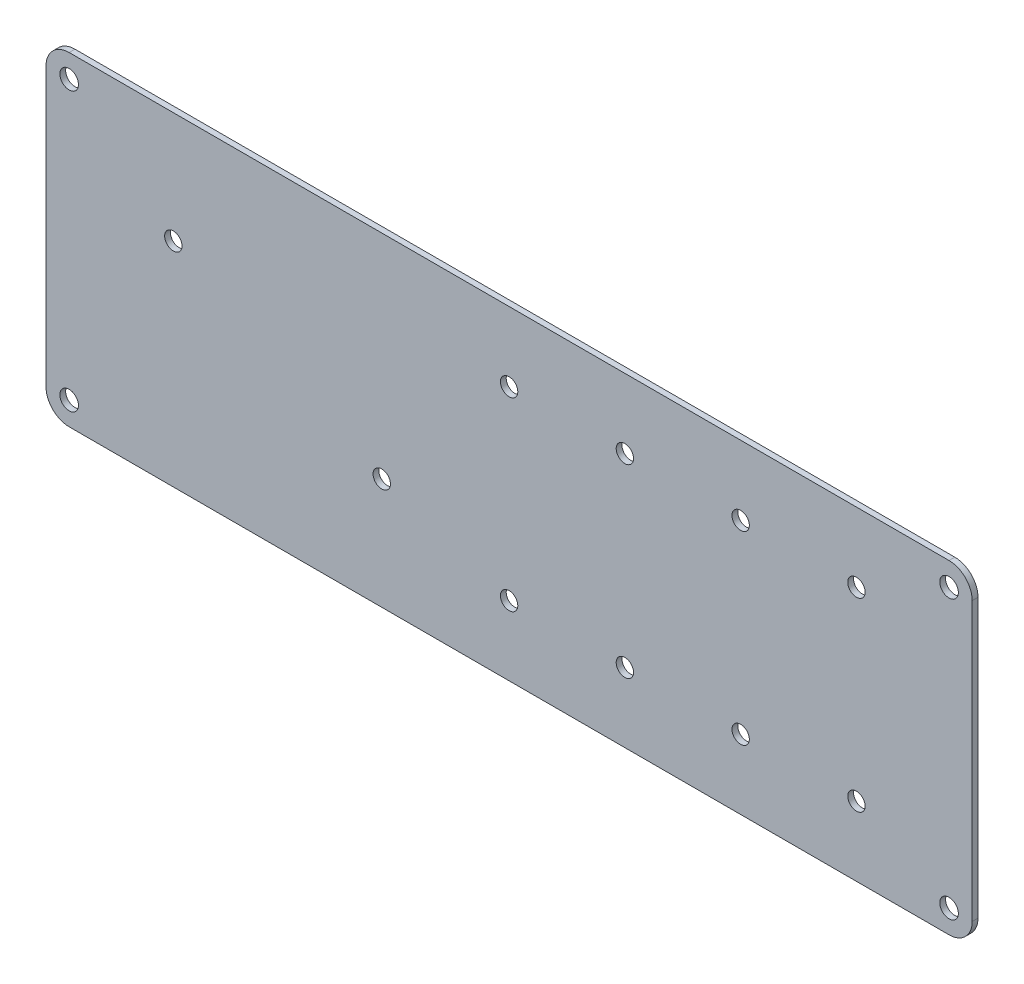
from build123d import *

# Parameters (mm, degrees)
SKETCH1_W           = 254
SKETCH1_H           = 88.9
BOSS_EXTRUDE1_DEPTH = 1.5875
SKETCH2_R           = 2.5527
CUT_EXTRUDE1_DEPTH  = 270.112857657
FILLET1_R           = 6.35
SKETCH3_R           = 2.38125
CUT_EXTRUDE2_DEPTH  = 1.5875
SKETCH4_R           = 2.38125
CUT_EXTRUDE3_DEPTH  = 3.175


with BuildPart() as part:
    # Sketch1 → Boss-Extrude1 (new body)
    with BuildSketch(Plane.XY):
        with Locations((127, 44.45)):
            Rectangle(SKETCH1_W, SKETCH1_H)
    extrude(amount=BOSS_EXTRUDE1_DEPTH)

    # Sketch2 → Cut-Extrude1 (cut, through all)
    with BuildSketch(Plane.XY.offset(1.5875)):
        with Locations((6.35, 82.55)):
            Circle(SKETCH2_R)
        with Locations((247.65, 82.55)):
            Circle(SKETCH2_R)
        with Locations((247.65, 6.35)):
            Circle(SKETCH2_R)
        with Locations((6.35, 6.35)):
            Circle(SKETCH2_R)
    extrude(amount=-CUT_EXTRUDE1_DEPTH, mode=Mode.SUBTRACT)

    # Fillet1
    fillet1_edges = [part.edges().sort_by_distance(p)[0] for p in [
        (0, 88.9, 0.79375),
        (254, 88.9, 0.79375),
        (254, 0, 0.79375),
        (0, 0, 0.79375),
    ]]
    fillet(fillet1_edges, radius=FILLET1_R)

    # Sketch3 → Cut-Extrude2 (cut)
    with BuildSketch(Plane(origin=(0, 0, 0), x_dir=(-1, 0, 0), z_dir=(0, 0, -1))):
        with Locations((-222.25, 19.05)):
            Circle(SKETCH3_R)
        with Locations((-190.5, 19.05)):
            Circle(SKETCH3_R)
        with Locations((-158.75, 19.05)):
            Circle(SKETCH3_R)
        with Locations((-127, 19.05)):
            Circle(SKETCH3_R)
        with Locations((-222.25, 69.85)):
            Circle(SKETCH3_R)
        with Locations((-190.5, 69.85)):
            Circle(SKETCH3_R)
        with Locations((-158.75, 69.85)):
            Circle(SKETCH3_R)
        with Locations((-127, 69.85)):
            Circle(SKETCH3_R)
    extrude(amount=-CUT_EXTRUDE2_DEPTH, mode=Mode.SUBTRACT)

    # Sketch4 → Cut-Extrude3 (cut)
    with BuildSketch(Plane(origin=(0, 0, 0), x_dir=(-1, 0, 0), z_dir=(0, 0, -1))):
        with Locations((-34.925, 58.42)):
            Circle(SKETCH4_R)
        with Locations((-92.075, 30.48)):
            Circle(SKETCH4_R)
    extrude(amount=-CUT_EXTRUDE3_DEPTH, mode=Mode.SUBTRACT)


solid = part.part
